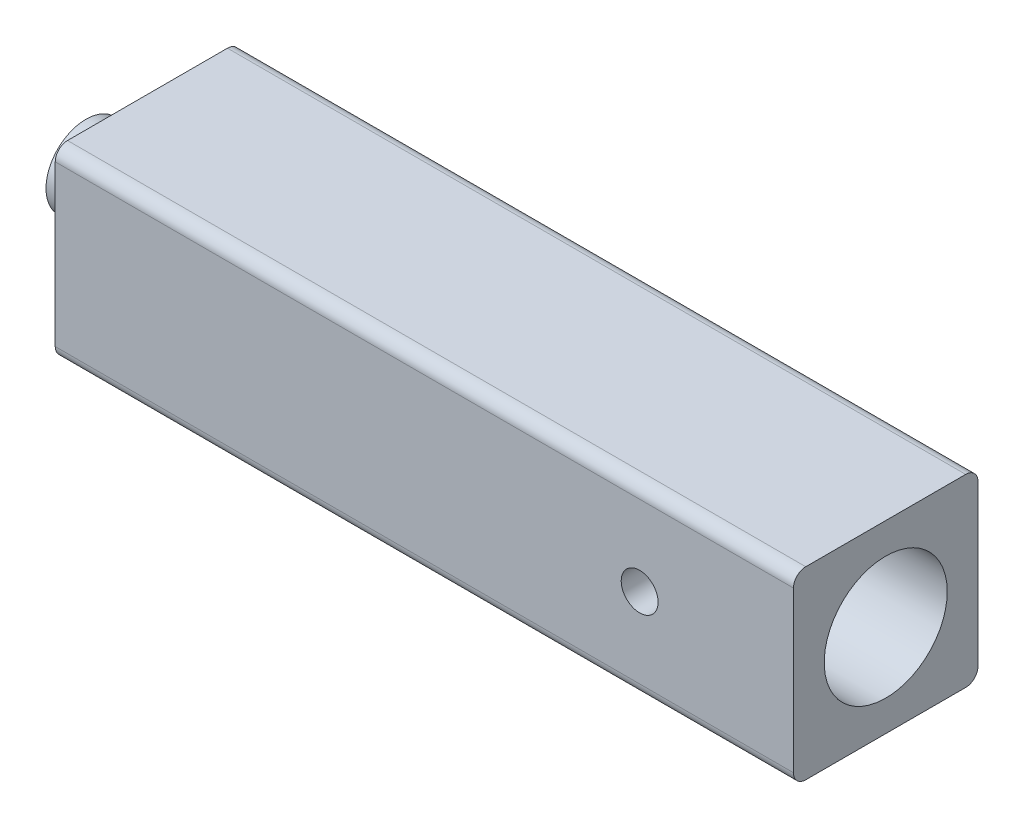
from build123d import *

# Parameters (mm, degrees)
SKETCH1_W           = 30
SKETCH1_H           = 30
BOSS_EXTRUDE1_DEPTH = 120
SKETCH2_R           = 10
CUT_EXTRUDE1_DEPTH  = 40
CUT_EXTRUDE2_DEPTH  = 20
SKETCH4_R           = 6.5
BOSS_EXTRUDE2_DEPTH = 10
FILLET1_R           = 2


with BuildPart() as part:
    # Sketch1 → Boss-Extrude1 (new body)
    with BuildSketch(Plane(origin=(0, 0, 0), x_dir=(0, 0, -1), z_dir=(1, 0, 0))):
        Rectangle(SKETCH1_W, SKETCH1_H)
    extrude(amount=BOSS_EXTRUDE1_DEPTH)

    # Sketch2 → Cut-Extrude1 (cut)
    with BuildSketch(Plane(origin=(120, 0, 0), x_dir=(0, 0, -1), z_dir=(1, 0, 0))):
        Circle(SKETCH2_R)
    extrude(amount=-CUT_EXTRUDE1_DEPTH, mode=Mode.SUBTRACT)

    # Sketch3 → Cut-Extrude2 (cut, symmetric)
    with BuildSketch(Plane.XY):
        with BuildLine():
            ThreePointArc((98, 0), (97.121320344, 2.121320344), (95, 3))
            Line((95, 3), (95, -3))
            ThreePointArc((95, -3), (97.121320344, -2.121320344), (98, 0))
        make_face()
        with BuildLine():
            Line((95, -3), (95, 3))
            ThreePointArc((95, 3), (92, 0), (95, -3))
        make_face()
        with BuildLine():
            ThreePointArc((98, 0), (97.121320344, 2.121320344), (95, 3))
            Line((95, 3), (95, -3))
            ThreePointArc((95, -3), (97.121320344, -2.121320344), (98, 0))
        make_face()
        with BuildLine():
            Line((95, -3), (95, 3))
            ThreePointArc((95, 3), (92, 0), (95, -3))
        make_face()
    extrude(amount=CUT_EXTRUDE2_DEPTH, both=True, mode=Mode.SUBTRACT)

    # Sketch4 → Boss-Extrude2 (add)
    with BuildSketch(Plane.ZY):
        with Locations(Location((0, 0, 0), (0, 0, 180))):
            Circle(SKETCH4_R)
    extrude(amount=BOSS_EXTRUDE2_DEPTH)

    # Fillet1
    fillet1_edges = [part.edges().sort_by_distance(p)[0] for p in [
        (60, 15, 15),
        (60, 15, -15),
        (60, -15, -15),
        (60, -15, 15),
    ]]
    fillet(fillet1_edges, radius=FILLET1_R)


solid = part.part
